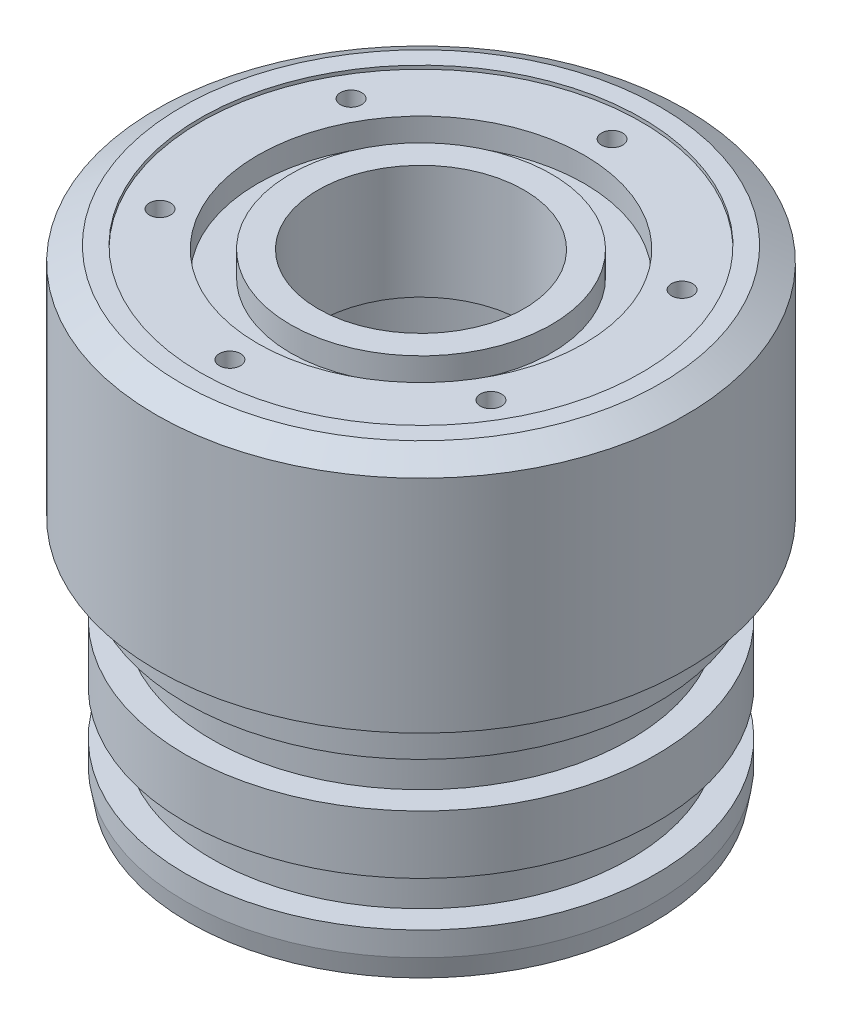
from build123d import *

# Parameters (mm, degrees)
SKETCH1_R           = 25.4
BOSS_EXTRUDE1_DEPTH = 25.4
SKETCH2_R           = 28.575
BOSS_EXTRUDE2_DEPTH = 25.4
SKETCH6_R           = 19.05
CUT_EXTRUDE3_DEPTH  = 38.1
CUT_EXTRUDE4_START  = -4.7498
SKETCH7_OUTSIDE_W   = 78.242
SKETCH7_OUTSIDE_H   = 78.242
SKETCH7_OUTSIDE_R   = 22.5806
CUT_EXTRUDE4_DEPTH  = 4.826
CUT_EXTRUDE6_START  = -15.875
SKETCH8_OUTSIDE_W   = 78.242
SKETCH8_OUTSIDE_H   = 78.242
SKETCH8_OUTSIDE_R   = 22.5806
CUT_EXTRUDE6_DEPTH  = 4.826
CHAMFER1_SIZE       = 0.381
CHAMFER1_SIZE2      = 2.160758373
CHAMFER2_SIZE       = 1.5748
CHAMFER2_SIZE2      = 2.727633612
SKETCH9_R           = 11.1125
CUT_EXTRUDE7_DEPTH  = 65.913028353
SKETCH10_R          = 23.8125
CUT_EXTRUDE8_DEPTH  = 0.381
SKETCH11_R          = 17.6149
SKETCH11_R_2        = 14.0843
CUT_EXTRUDE9_DEPTH  = 2.6416
SKETCH12_R          = 1.143
CUT_EXTRUDE10_DEPTH = 7.9248
CIRPATTERN1_COUNT   = 6


with BuildPart() as part:
    # Sketch1 → Boss-Extrude1 (new body)
    with BuildSketch(Plane(origin=(0, 0, 0), x_dir=(1, 0, 0), z_dir=(0, 1, 0))):
        with Locations(Location((0, 0, 0), (0, 0, 270))):
            Circle(SKETCH1_R)
    extrude(amount=-BOSS_EXTRUDE1_DEPTH)

    # Sketch2 → Boss-Extrude2 (add)
    with BuildSketch(Plane(origin=(0, 0, 0), x_dir=(1, 0, 0), z_dir=(0, 1, 0))):
        with Locations(Location((0, 0, 0), (0, 0, 270))):
            Circle(SKETCH2_R)
    extrude(amount=BOSS_EXTRUDE2_DEPTH)

    # Sketch6 → Cut-Extrude3 (cut)
    with BuildSketch(Plane.XZ.offset(25.4)):
        with Locations(Location((0, 0, 0), (0, 0, 270))):
            Circle(SKETCH6_R)
    extrude(amount=-CUT_EXTRUDE3_DEPTH, mode=Mode.SUBTRACT)

    # Sketch7 outside → Cut-Extrude4 (cut)
    with BuildSketch(Plane.XZ.offset(25.4).offset(CUT_EXTRUDE4_START)):
        Rectangle(SKETCH7_OUTSIDE_W, SKETCH7_OUTSIDE_H)
        with Locations(Location((0, 0, 0), (0, 0, 270))):
            Circle(SKETCH7_OUTSIDE_R, mode=Mode.SUBTRACT)
    extrude(amount=-CUT_EXTRUDE4_DEPTH, mode=Mode.SUBTRACT)

    # Sketch8 outside → Cut-Extrude6 (cut)
    with BuildSketch(Plane.XZ.offset(25.4).offset(CUT_EXTRUDE6_START)):
        Rectangle(SKETCH8_OUTSIDE_W, SKETCH8_OUTSIDE_H)
        with Locations(Location((0, 0, 0), (0, 0, 270))):
            Circle(SKETCH8_OUTSIDE_R, mode=Mode.SUBTRACT)
    extrude(amount=-CUT_EXTRUDE6_DEPTH, mode=Mode.SUBTRACT)

    # Chamfer1
    chamfer1_edges = [part.edges().sort_by_distance(p)[0] for p in [
        (0, -25.4, -25.4),
    ]]
    chamfer1_side = [part.faces().sort_by_distance(p)[0] for p in [
        (0, -25.4, -24.68157951),
    ]]
    chamfer(chamfer1_edges, length=CHAMFER1_SIZE, length2=CHAMFER1_SIZE2, reference=chamfer1_side[0])

    # Chamfer2
    chamfer2_edges = [part.edges().sort_by_distance(p)[0] for p in [
        (0, 25.4, -28.575),
    ]]
    chamfer2_side = [part.faces().sort_by_distance(p)[0] for p in [
        (0, 12.7, -28.575),
    ]]
    chamfer(chamfer2_edges, length=CHAMFER2_SIZE, length2=CHAMFER2_SIZE2, reference=chamfer2_side[0])

    # Sketch9 → Cut-Extrude7 (cut, through all)
    with BuildSketch(Plane(origin=(0, 25.4, 0), x_dir=(1, 0, 0), z_dir=(0, 1, 0))):
        with Locations(Location((0, 0, 0), (0, 0, 270))):
            Circle(SKETCH9_R)
    extrude(amount=-CUT_EXTRUDE7_DEPTH, mode=Mode.SUBTRACT)

    # Sketch10 → Cut-Extrude8 (cut)
    with BuildSketch(Plane(origin=(0, 25.4, 0), x_dir=(1, 0, 0), z_dir=(0, 1, 0))):
        with Locations(Location((0, 0, 0), (0, 0, 270))):
            Circle(SKETCH10_R)
    extrude(amount=-CUT_EXTRUDE8_DEPTH, mode=Mode.SUBTRACT)

    # Sketch11 → Cut-Extrude9 (cut)
    with BuildSketch(Plane(origin=(0, 25.019, 0), x_dir=(1, 0, 0), z_dir=(0, 1, 0))):
        with Locations(Location((0, 0, 0), (0, 0, 270))):
            Circle(SKETCH11_R)
        with Locations(Location((0, 0, 0), (0, 0, 270))):
            Circle(SKETCH11_R_2, mode=Mode.SUBTRACT)
    extrude(amount=-CUT_EXTRUDE9_DEPTH, mode=Mode.SUBTRACT)

    # Sketch12 → Cut-Extrude10 (cut)
    with BuildSketch(Plane(origin=(0, 25.019, 0), x_dir=(1, 0, 0), z_dir=(0, 1, 0))):
        with Locations(Location((0, 20.6248, 0), (0, 0, 270))):
            Circle(SKETCH12_R)
    cut_extrude10 = extrude(amount=-CUT_EXTRUDE10_DEPTH, mode=Mode.SUBTRACT)

    # CirPattern1: Cut-Extrude10 ×6 about axis
    cirpattern1_axis = Axis((0, 0, 0), (0, 1, 0))
    for i in range(1, CIRPATTERN1_COUNT):
        add(cut_extrude10.rotate(cirpattern1_axis, i * 360 / CIRPATTERN1_COUNT), mode=Mode.SUBTRACT)


solid = part.part
